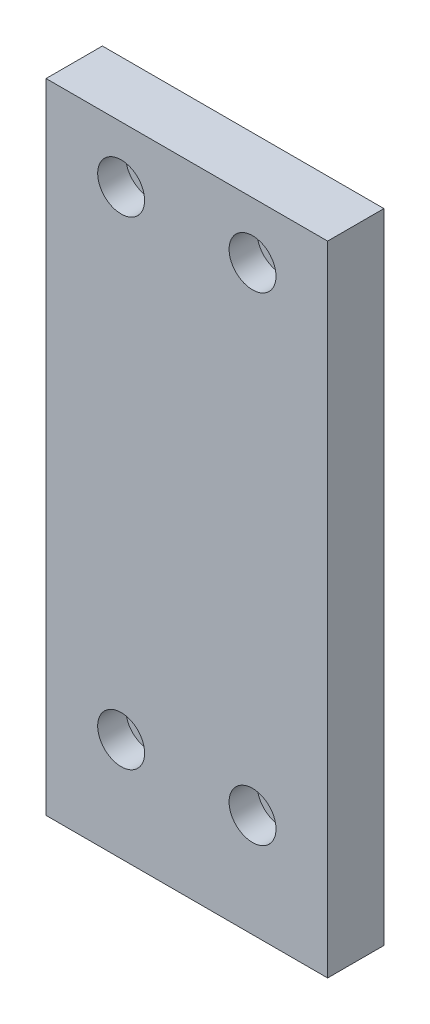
ISO-10303-21;
HEADER;
FILE_DESCRIPTION(('STEP AP214'),'2;1');
FILE_NAME('part.step','',(''),(''),'','','');
FILE_SCHEMA(('AUTOMOTIVE_DESIGN { 1 0 10303 214 1 1 1 1 }'));
ENDSEC;
DATA;
#1=APPLICATION_CONTEXT('core data for automotive mechanical design processes');
#2=APPLICATION_PROTOCOL_DEFINITION('international standard','automotive_design',2000,#1);
#3=PRODUCT_CONTEXT('',#1,'mechanical');
#4=PRODUCT('Part','Part','',(#3));
#5=PRODUCT_RELATED_PRODUCT_CATEGORY('part','',(#4));
#6=PRODUCT_DEFINITION_FORMATION('','',#4);
#7=PRODUCT_DEFINITION_CONTEXT('part definition',#1,'design');
#8=PRODUCT_DEFINITION('design','',#6,#7);
#9=PRODUCT_DEFINITION_SHAPE('','',#8);
#10=(LENGTH_UNIT() NAMED_UNIT(*) SI_UNIT(.MILLI.,.METRE.));
#11=(NAMED_UNIT(*) PLANE_ANGLE_UNIT() SI_UNIT($,.RADIAN.));
#12=(NAMED_UNIT(*) SI_UNIT($,.STERADIAN.) SOLID_ANGLE_UNIT());
#13=UNCERTAINTY_MEASURE_WITH_UNIT(LENGTH_MEASURE(1.E-05),#10,'distance_accuracy_value','');
#14=(GEOMETRIC_REPRESENTATION_CONTEXT(3) GLOBAL_UNCERTAINTY_ASSIGNED_CONTEXT((#13)) GLOBAL_UNIT_ASSIGNED_CONTEXT((#10,
#11,#12)) REPRESENTATION_CONTEXT('',''));
#15=CARTESIAN_POINT('',(0.,0.,0.));
#16=DIRECTION('',(0.,0.,1.));
#17=DIRECTION('',(1.,0.,0.));
#18=AXIS2_PLACEMENT_3D('',#15,#16,#17);
#19=CARTESIAN_POINT('',(0.,215.9,0.));
#20=DIRECTION('',(1.,0.,0.));
#21=DIRECTION('',(0.,0.,-1.));
#22=AXIS2_PLACEMENT_3D('',#19,#20,#21);
#23=PLANE('',#22);
#24=DIRECTION('',(0.,0.,1.));
#25=VECTOR('',#24,1.);
#26=CARTESIAN_POINT('',(0.,0.,0.));
#27=LINE('',#26,#25);
#28=CARTESIAN_POINT('',(0.,0.,-19.05));
#29=VERTEX_POINT('',#28);
#30=CARTESIAN_POINT('',(0.,0.,0.));
#31=VERTEX_POINT('',#30);
#32=EDGE_CURVE('E109',#29,#31,#27,.T.);
#33=ORIENTED_EDGE('',*,*,#32,.T.);
#34=DIRECTION('',(0.,-1.,0.));
#35=VECTOR('',#34,1.);
#36=CARTESIAN_POINT('',(0.,215.9,0.));
#37=LINE('',#36,#35);
#38=CARTESIAN_POINT('',(0.,215.9,0.));
#39=VERTEX_POINT('',#38);
#40=EDGE_CURVE('E11',#39,#31,#37,.T.);
#41=ORIENTED_EDGE('',*,*,#40,.F.);
#42=DIRECTION('',(0.,0.,1.));
#43=VECTOR('',#42,1.);
#44=CARTESIAN_POINT('',(0.,215.9,0.));
#45=LINE('',#44,#43);
#46=CARTESIAN_POINT('',(0.,215.9,-19.05));
#47=VERTEX_POINT('',#46);
#48=EDGE_CURVE('E110',#47,#39,#45,.T.);
#49=ORIENTED_EDGE('',*,*,#48,.F.);
#50=DIRECTION('',(0.,-1.,0.));
#51=VECTOR('',#50,1.);
#52=CARTESIAN_POINT('',(0.,215.9,-19.05));
#53=LINE('',#52,#51);
#54=EDGE_CURVE('E116',#47,#29,#53,.T.);
#55=ORIENTED_EDGE('',*,*,#54,.T.);
#56=EDGE_LOOP('',(#33,#41,#49,#55));
#57=FACE_BOUND('',#56,.T.);
#58=ADVANCED_FACE('F32',(#57),#23,.F.);
#59=CARTESIAN_POINT('',(0.,215.9,0.));
#60=DIRECTION('',(0.,0.,-1.));
#61=DIRECTION('',(-1.,0.,0.));
#62=AXIS2_PLACEMENT_3D('',#59,#60,#61);
#63=PLANE('',#62);
#64=CARTESIAN_POINT('',(25.4,34.925,0.));
#65=DIRECTION('',(0.,0.,1.));
#66=DIRECTION('',(1.,0.,0.));
#67=AXIS2_PLACEMENT_3D('',#64,#65,#66);
#68=CIRCLE('',#67,7.9375);
#69=CARTESIAN_POINT('',(33.3375,34.925,0.));
#70=VERTEX_POINT('',#69);
#71=EDGE_CURVE('E158',#70,#70,#68,.T.);
#72=ORIENTED_EDGE('',*,*,#71,.F.);
#73=EDGE_LOOP('',(#72));
#74=FACE_BOUND('',#73,.T.);
#75=CARTESIAN_POINT('',(69.85,34.925,0.));
#76=DIRECTION('',(0.,0.,1.));
#77=DIRECTION('',(1.,0.,0.));
#78=AXIS2_PLACEMENT_3D('',#75,#76,#77);
#79=CIRCLE('',#78,7.9375);
#80=CARTESIAN_POINT('',(77.7875,34.925,0.));
#81=VERTEX_POINT('',#80);
#82=EDGE_CURVE('E162',#81,#81,#79,.T.);
#83=ORIENTED_EDGE('',*,*,#82,.F.);
#84=EDGE_LOOP('',(#83));
#85=FACE_BOUND('',#84,.T.);
#86=CARTESIAN_POINT('',(69.85,196.85,0.));
#87=DIRECTION('',(0.,0.,1.));
#88=DIRECTION('',(1.,0.,0.));
#89=AXIS2_PLACEMENT_3D('',#86,#87,#88);
#90=CIRCLE('',#89,7.9375);
#91=CARTESIAN_POINT('',(77.7875,196.85,0.));
#92=VERTEX_POINT('',#91);
#93=EDGE_CURVE('E166',#92,#92,#90,.T.);
#94=ORIENTED_EDGE('',*,*,#93,.F.);
#95=EDGE_LOOP('',(#94));
#96=FACE_BOUND('',#95,.T.);
#97=CARTESIAN_POINT('',(25.4,196.85,0.));
#98=DIRECTION('',(0.,0.,1.));
#99=DIRECTION('',(1.,0.,0.));
#100=AXIS2_PLACEMENT_3D('',#97,#98,#99);
#101=CIRCLE('',#100,7.9375);
#102=CARTESIAN_POINT('',(33.3375,196.85,0.));
#103=VERTEX_POINT('',#102);
#104=EDGE_CURVE('E169',#103,#103,#101,.T.);
#105=ORIENTED_EDGE('',*,*,#104,.F.);
#106=EDGE_LOOP('',(#105));
#107=FACE_BOUND('',#106,.T.);
#108=DIRECTION('',(1.,0.,0.));
#109=VECTOR('',#108,1.);
#110=CARTESIAN_POINT('',(0.,0.,0.));
#111=LINE('',#110,#109);
#112=CARTESIAN_POINT('',(95.25,0.,0.));
#113=VERTEX_POINT('',#112);
#114=EDGE_CURVE('E119',#31,#113,#111,.T.);
#115=ORIENTED_EDGE('',*,*,#114,.T.);
#116=DIRECTION('',(0.,-1.,0.));
#117=VECTOR('',#116,1.);
#118=CARTESIAN_POINT('',(95.25,215.9,0.));
#119=LINE('',#118,#117);
#120=CARTESIAN_POINT('',(95.25,215.9,0.));
#121=VERTEX_POINT('',#120);
#122=EDGE_CURVE('E40',#121,#113,#119,.T.);
#123=ORIENTED_EDGE('',*,*,#122,.F.);
#124=DIRECTION('',(1.,0.,0.));
#125=VECTOR('',#124,1.);
#126=CARTESIAN_POINT('',(0.,215.9,0.));
#127=LINE('',#126,#125);
#128=EDGE_CURVE('E79',#39,#121,#127,.T.);
#129=ORIENTED_EDGE('',*,*,#128,.F.);
#130=ORIENTED_EDGE('',*,*,#40,.T.);
#131=EDGE_LOOP('',(#115,#123,#129,#130));
#132=FACE_BOUND('',#131,.T.);
#133=ADVANCED_FACE('F143',(#74,#85,#96,#107,#132),#63,.F.);
#134=CARTESIAN_POINT('',(95.25,215.9,0.));
#135=DIRECTION('',(-1.,0.,0.));
#136=DIRECTION('',(0.,0.,1.));
#137=AXIS2_PLACEMENT_3D('',#134,#135,#136);
#138=PLANE('',#137);
#139=DIRECTION('',(0.,0.,-1.));
#140=VECTOR('',#139,1.);
#141=CARTESIAN_POINT('',(95.25,0.,0.));
#142=LINE('',#141,#140);
#143=CARTESIAN_POINT('',(95.25,0.,-19.05));
#144=VERTEX_POINT('',#143);
#145=EDGE_CURVE('E66',#113,#144,#142,.T.);
#146=ORIENTED_EDGE('',*,*,#145,.T.);
#147=DIRECTION('',(0.,-1.,0.));
#148=VECTOR('',#147,1.);
#149=CARTESIAN_POINT('',(95.25,215.9,-19.05));
#150=LINE('',#149,#148);
#151=CARTESIAN_POINT('',(95.25,215.9,-19.05));
#152=VERTEX_POINT('',#151);
#153=EDGE_CURVE('E124',#152,#144,#150,.T.);
#154=ORIENTED_EDGE('',*,*,#153,.F.);
#155=DIRECTION('',(0.,0.,-1.));
#156=VECTOR('',#155,1.);
#157=CARTESIAN_POINT('',(95.25,215.9,0.));
#158=LINE('',#157,#156);
#159=EDGE_CURVE('E113',#121,#152,#158,.T.);
#160=ORIENTED_EDGE('',*,*,#159,.F.);
#161=ORIENTED_EDGE('',*,*,#122,.T.);
#162=EDGE_LOOP('',(#146,#154,#160,#161));
#163=FACE_BOUND('',#162,.T.);
#164=ADVANCED_FACE('F126',(#163),#138,.F.);
#165=CARTESIAN_POINT('',(0.,215.9,-19.05));
#166=DIRECTION('',(0.,0.,1.));
#167=DIRECTION('',(1.,0.,0.));
#168=AXIS2_PLACEMENT_3D('',#165,#166,#167);
#169=PLANE('',#168);
#170=CARTESIAN_POINT('',(25.4,34.925,-19.05));
#171=DIRECTION('',(0.,0.,1.));
#172=DIRECTION('',(1.,0.,0.));
#173=AXIS2_PLACEMENT_3D('',#170,#171,#172);
#174=CIRCLE('',#173,5.04189999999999);
#175=CARTESIAN_POINT('',(30.4419,34.925,-19.05));
#176=VERTEX_POINT('',#175);
#177=EDGE_CURVE('E356',#176,#176,#174,.T.);
#178=ORIENTED_EDGE('',*,*,#177,.T.);
#179=EDGE_LOOP('',(#178));
#180=FACE_BOUND('',#179,.T.);
#181=CARTESIAN_POINT('',(69.85,34.925,-19.05));
#182=DIRECTION('',(0.,0.,1.));
#183=DIRECTION('',(1.,0.,0.));
#184=AXIS2_PLACEMENT_3D('',#181,#182,#183);
#185=CIRCLE('',#184,5.0419);
#186=CARTESIAN_POINT('',(74.8919,34.925,-19.05));
#187=VERTEX_POINT('',#186);
#188=EDGE_CURVE('E365',#187,#187,#185,.T.);
#189=ORIENTED_EDGE('',*,*,#188,.T.);
#190=EDGE_LOOP('',(#189));
#191=FACE_BOUND('',#190,.T.);
#192=CARTESIAN_POINT('',(69.85,196.85,-19.05));
#193=DIRECTION('',(0.,0.,1.));
#194=DIRECTION('',(1.,0.,0.));
#195=AXIS2_PLACEMENT_3D('',#192,#193,#194);
#196=CIRCLE('',#195,5.0419);
#197=CARTESIAN_POINT('',(74.8919,196.85,-19.05));
#198=VERTEX_POINT('',#197);
#199=EDGE_CURVE('E172',#198,#198,#196,.T.);
#200=ORIENTED_EDGE('',*,*,#199,.T.);
#201=EDGE_LOOP('',(#200));
#202=FACE_BOUND('',#201,.T.);
#203=CARTESIAN_POINT('',(25.4,196.85,-19.05));
#204=DIRECTION('',(0.,0.,1.));
#205=DIRECTION('',(1.,0.,0.));
#206=AXIS2_PLACEMENT_3D('',#203,#204,#205);
#207=CIRCLE('',#206,5.04189999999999);
#208=CARTESIAN_POINT('',(30.4419,196.85,-19.05));
#209=VERTEX_POINT('',#208);
#210=EDGE_CURVE('E103',#209,#209,#207,.T.);
#211=ORIENTED_EDGE('',*,*,#210,.T.);
#212=EDGE_LOOP('',(#211));
#213=FACE_BOUND('',#212,.T.);
#214=DIRECTION('',(-1.,0.,0.));
#215=VECTOR('',#214,1.);
#216=CARTESIAN_POINT('',(0.,0.,-19.05));
#217=LINE('',#216,#215);
#218=EDGE_CURVE('E72',#144,#29,#217,.T.);
#219=ORIENTED_EDGE('',*,*,#218,.T.);
#220=ORIENTED_EDGE('',*,*,#54,.F.);
#221=DIRECTION('',(-1.,0.,0.));
#222=VECTOR('',#221,1.);
#223=CARTESIAN_POINT('',(0.,215.9,-19.05));
#224=LINE('',#223,#222);
#225=EDGE_CURVE('E48',#152,#47,#224,.T.);
#226=ORIENTED_EDGE('',*,*,#225,.F.);
#227=ORIENTED_EDGE('',*,*,#153,.T.);
#228=EDGE_LOOP('',(#219,#220,#226,#227));
#229=FACE_BOUND('',#228,.T.);
#230=ADVANCED_FACE('F133',(#180,#191,#202,#213,#229),#169,.F.);
#231=CARTESIAN_POINT('',(0.,215.9,-19.05));
#232=DIRECTION('',(0.,-1.,0.));
#233=DIRECTION('',(0.,0.,-1.));
#234=AXIS2_PLACEMENT_3D('',#231,#232,#233);
#235=PLANE('',#234);
#236=ORIENTED_EDGE('',*,*,#48,.T.);
#237=ORIENTED_EDGE('',*,*,#128,.T.);
#238=ORIENTED_EDGE('',*,*,#159,.T.);
#239=ORIENTED_EDGE('',*,*,#225,.T.);
#240=EDGE_LOOP('',(#236,#237,#238,#239));
#241=FACE_BOUND('',#240,.T.);
#242=ADVANCED_FACE('F135',(#241),#235,.F.);
#243=CARTESIAN_POINT('',(0.,0.,-19.05));
#244=DIRECTION('',(0.,-1.,0.));
#245=DIRECTION('',(0.,0.,-1.));
#246=AXIS2_PLACEMENT_3D('',#243,#244,#245);
#247=PLANE('',#246);
#248=CARTESIAN_POINT('',(9.52500000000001,0.,-9.525));
#249=DIRECTION('',(0.,-1.,0.));
#250=DIRECTION('',(0.,0.,-1.));
#251=AXIS2_PLACEMENT_3D('',#248,#249,#250);
#252=CIRCLE('',#251,3.96875);
#253=CARTESIAN_POINT('',(9.52500000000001,0.,-13.49375));
#254=VERTEX_POINT('',#253);
#255=EDGE_CURVE('E97',#254,#254,#252,.T.);
#256=ORIENTED_EDGE('',*,*,#255,.F.);
#257=EDGE_LOOP('',(#256));
#258=FACE_BOUND('',#257,.T.);
#259=CARTESIAN_POINT('',(85.725,0.,-9.525));
#260=DIRECTION('',(0.,-1.,0.));
#261=DIRECTION('',(0.,0.,-1.));
#262=AXIS2_PLACEMENT_3D('',#259,#260,#261);
#263=CIRCLE('',#262,3.96874999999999);
#264=CARTESIAN_POINT('',(85.725,0.,-13.49375));
#265=VERTEX_POINT('',#264);
#266=EDGE_CURVE('E96',#265,#265,#263,.T.);
#267=ORIENTED_EDGE('',*,*,#266,.F.);
#268=EDGE_LOOP('',(#267));
#269=FACE_BOUND('',#268,.T.);
#270=ORIENTED_EDGE('',*,*,#32,.F.);
#271=ORIENTED_EDGE('',*,*,#218,.F.);
#272=ORIENTED_EDGE('',*,*,#145,.F.);
#273=ORIENTED_EDGE('',*,*,#114,.F.);
#274=EDGE_LOOP('',(#270,#271,#272,#273));
#275=FACE_BOUND('',#274,.T.);
#276=ADVANCED_FACE('F129',(#258,#269,#275),#247,.T.);
#277=CARTESIAN_POINT('',(85.725,26.924,-9.525));
#278=DIRECTION('',(0.,-1.,0.));
#279=DIRECTION('',(0.,0.,-1.));
#280=AXIS2_PLACEMENT_3D('',#277,#278,#279);
#281=CONICAL_SURFACE('',#280,3.96874999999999,1.02974425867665);
#282=CARTESIAN_POINT('',(85.725,29.3086655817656,-9.525));
#283=VERTEX_POINT('',#282);
#284=VERTEX_LOOP('',#283);
#285=FACE_BOUND('',#284,.T.);
#286=CARTESIAN_POINT('',(85.725,26.924,-9.525));
#287=DIRECTION('',(0.,-1.,0.));
#288=DIRECTION('',(0.,0.,-1.));
#289=AXIS2_PLACEMENT_3D('',#286,#287,#288);
#290=CIRCLE('',#289,3.96874999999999);
#291=CARTESIAN_POINT('',(85.725,26.924,-13.49375));
#292=VERTEX_POINT('',#291);
#293=EDGE_CURVE('E100',#292,#292,#290,.T.);
#294=ORIENTED_EDGE('',*,*,#293,.T.);
#295=EDGE_LOOP('',(#294));
#296=FACE_BOUND('',#295,.T.);
#297=ADVANCED_FACE('F215',(#285,#296),#281,.F.);
#298=CARTESIAN_POINT('',(85.725,0.,-9.525));
#299=DIRECTION('',(0.,-1.,0.));
#300=DIRECTION('',(0.,0.,-1.));
#301=AXIS2_PLACEMENT_3D('',#298,#299,#300);
#302=CYLINDRICAL_SURFACE('',#301,3.96874999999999);
#303=ORIENTED_EDGE('',*,*,#293,.F.);
#304=EDGE_LOOP('',(#303));
#305=FACE_BOUND('',#304,.T.);
#306=ORIENTED_EDGE('',*,*,#266,.T.);
#307=EDGE_LOOP('',(#306));
#308=FACE_BOUND('',#307,.T.);
#309=ADVANCED_FACE('F90',(#305,#308),#302,.F.);
#310=CARTESIAN_POINT('',(9.52500000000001,26.924,-9.525));
#311=DIRECTION('',(0.,-1.,0.));
#312=DIRECTION('',(0.,0.,-1.));
#313=AXIS2_PLACEMENT_3D('',#310,#311,#312);
#314=CONICAL_SURFACE('',#313,3.96874999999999,1.02974425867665);
#315=CARTESIAN_POINT('',(9.525,29.3086655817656,-9.525));
#316=VERTEX_POINT('',#315);
#317=VERTEX_LOOP('',#316);
#318=FACE_BOUND('',#317,.T.);
#319=CARTESIAN_POINT('',(9.52500000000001,26.924,-9.525));
#320=DIRECTION('',(0.,-1.,0.));
#321=DIRECTION('',(0.,0.,-1.));
#322=AXIS2_PLACEMENT_3D('',#319,#320,#321);
#323=CIRCLE('',#322,3.96874999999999);
#324=CARTESIAN_POINT('',(9.52500000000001,26.924,-13.49375));
#325=VERTEX_POINT('',#324);
#326=EDGE_CURVE('E94',#325,#325,#323,.T.);
#327=ORIENTED_EDGE('',*,*,#326,.T.);
#328=EDGE_LOOP('',(#327));
#329=FACE_BOUND('',#328,.T.);
#330=ADVANCED_FACE('F86',(#318,#329),#314,.F.);
#331=CARTESIAN_POINT('',(9.52500000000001,0.,-9.525));
#332=DIRECTION('',(0.,-1.,0.));
#333=DIRECTION('',(0.,0.,-1.));
#334=AXIS2_PLACEMENT_3D('',#331,#332,#333);
#335=CYLINDRICAL_SURFACE('',#334,3.96875);
#336=ORIENTED_EDGE('',*,*,#326,.F.);
#337=EDGE_LOOP('',(#336));
#338=FACE_BOUND('',#337,.T.);
#339=ORIENTED_EDGE('',*,*,#255,.T.);
#340=EDGE_LOOP('',(#339));
#341=FACE_BOUND('',#340,.T.);
#342=ADVANCED_FACE('F89',(#338,#341),#335,.F.);
#343=CARTESIAN_POINT('',(25.4,196.85,0.));
#344=DIRECTION('',(0.,0.,1.));
#345=DIRECTION('',(1.,0.,0.));
#346=AXIS2_PLACEMENT_3D('',#343,#344,#345);
#347=CYLINDRICAL_SURFACE('',#346,5.0419);
#348=ORIENTED_EDGE('',*,*,#210,.F.);
#349=EDGE_LOOP('',(#348));
#350=FACE_BOUND('',#349,.T.);
#351=CARTESIAN_POINT('',(25.4,196.85,-9.525));
#352=DIRECTION('',(0.,0.,1.));
#353=DIRECTION('',(1.,0.,0.));
#354=AXIS2_PLACEMENT_3D('',#351,#352,#353);
#355=CIRCLE('',#354,5.04190000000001);
#356=CARTESIAN_POINT('',(30.4419,196.85,-9.525));
#357=VERTEX_POINT('',#356);
#358=EDGE_CURVE('E175',#357,#357,#355,.T.);
#359=ORIENTED_EDGE('',*,*,#358,.T.);
#360=EDGE_LOOP('',(#359));
#361=FACE_BOUND('',#360,.T.);
#362=ADVANCED_FACE('F187',(#350,#361),#347,.F.);
#363=CARTESIAN_POINT('',(30.4419,196.85,-9.525));
#364=DIRECTION('',(0.,0.,-1.));
#365=DIRECTION('',(-1.,0.,0.));
#366=AXIS2_PLACEMENT_3D('',#363,#364,#365);
#367=PLANE('',#366);
#368=ORIENTED_EDGE('',*,*,#358,.F.);
#369=EDGE_LOOP('',(#368));
#370=FACE_BOUND('',#369,.T.);
#371=CARTESIAN_POINT('',(25.4,196.85,-9.525));
#372=DIRECTION('',(0.,0.,1.));
#373=DIRECTION('',(1.,0.,0.));
#374=AXIS2_PLACEMENT_3D('',#371,#372,#373);
#375=CIRCLE('',#374,7.93749999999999);
#376=CARTESIAN_POINT('',(33.3375,196.85,-9.525));
#377=VERTEX_POINT('',#376);
#378=EDGE_CURVE('E171',#377,#377,#375,.T.);
#379=ORIENTED_EDGE('',*,*,#378,.T.);
#380=EDGE_LOOP('',(#379));
#381=FACE_BOUND('',#380,.T.);
#382=ADVANCED_FACE('F190',(#370,#381),#367,.F.);
#383=CARTESIAN_POINT('',(25.4,196.85,0.));
#384=DIRECTION('',(0.,0.,1.));
#385=DIRECTION('',(1.,0.,0.));
#386=AXIS2_PLACEMENT_3D('',#383,#384,#385);
#387=CYLINDRICAL_SURFACE('',#386,7.9375);
#388=ORIENTED_EDGE('',*,*,#378,.F.);
#389=EDGE_LOOP('',(#388));
#390=FACE_BOUND('',#389,.T.);
#391=ORIENTED_EDGE('',*,*,#104,.T.);
#392=EDGE_LOOP('',(#391));
#393=FACE_BOUND('',#392,.T.);
#394=ADVANCED_FACE('F196',(#390,#393),#387,.F.);
#395=CARTESIAN_POINT('',(69.85,196.85,0.));
#396=DIRECTION('',(0.,0.,1.));
#397=DIRECTION('',(1.,0.,0.));
#398=AXIS2_PLACEMENT_3D('',#395,#396,#397);
#399=CYLINDRICAL_SURFACE('',#398,5.04190000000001);
#400=ORIENTED_EDGE('',*,*,#199,.F.);
#401=EDGE_LOOP('',(#400));
#402=FACE_BOUND('',#401,.T.);
#403=CARTESIAN_POINT('',(69.85,196.85,-9.525));
#404=DIRECTION('',(0.,0.,1.));
#405=DIRECTION('',(1.,0.,0.));
#406=AXIS2_PLACEMENT_3D('',#403,#404,#405);
#407=CIRCLE('',#406,5.04190000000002);
#408=CARTESIAN_POINT('',(74.8919,196.85,-9.525));
#409=VERTEX_POINT('',#408);
#410=EDGE_CURVE('E178',#409,#409,#407,.T.);
#411=ORIENTED_EDGE('',*,*,#410,.T.);
#412=EDGE_LOOP('',(#411));
#413=FACE_BOUND('',#412,.T.);
#414=ADVANCED_FACE('F201',(#402,#413),#399,.F.);
#415=CARTESIAN_POINT('',(74.8919,196.85,-9.525));
#416=DIRECTION('',(0.,0.,-1.));
#417=DIRECTION('',(-1.,0.,0.));
#418=AXIS2_PLACEMENT_3D('',#415,#416,#417);
#419=PLANE('',#418);
#420=ORIENTED_EDGE('',*,*,#410,.F.);
#421=EDGE_LOOP('',(#420));
#422=FACE_BOUND('',#421,.T.);
#423=CARTESIAN_POINT('',(69.85,196.85,-9.525));
#424=DIRECTION('',(0.,0.,1.));
#425=DIRECTION('',(1.,0.,0.));
#426=AXIS2_PLACEMENT_3D('',#423,#424,#425);
#427=CIRCLE('',#426,7.93749999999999);
#428=CARTESIAN_POINT('',(77.7875,196.85,-9.525));
#429=VERTEX_POINT('',#428);
#430=EDGE_CURVE('E369',#429,#429,#427,.T.);
#431=ORIENTED_EDGE('',*,*,#430,.T.);
#432=EDGE_LOOP('',(#431));
#433=FACE_BOUND('',#432,.T.);
#434=ADVANCED_FACE('F206',(#422,#433),#419,.F.);
#435=CARTESIAN_POINT('',(69.85,196.85,0.));
#436=DIRECTION('',(0.,0.,1.));
#437=DIRECTION('',(1.,0.,0.));
#438=AXIS2_PLACEMENT_3D('',#435,#436,#437);
#439=CYLINDRICAL_SURFACE('',#438,7.93749999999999);
#440=ORIENTED_EDGE('',*,*,#430,.F.);
#441=EDGE_LOOP('',(#440));
#442=FACE_BOUND('',#441,.T.);
#443=ORIENTED_EDGE('',*,*,#93,.T.);
#444=EDGE_LOOP('',(#443));
#445=FACE_BOUND('',#444,.T.);
#446=ADVANCED_FACE('F273',(#442,#445),#439,.F.);
#447=CARTESIAN_POINT('',(69.85,34.925,0.));
#448=DIRECTION('',(0.,0.,1.));
#449=DIRECTION('',(1.,0.,0.));
#450=AXIS2_PLACEMENT_3D('',#447,#448,#449);
#451=CYLINDRICAL_SURFACE('',#450,5.04190000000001);
#452=ORIENTED_EDGE('',*,*,#188,.F.);
#453=EDGE_LOOP('',(#452));
#454=FACE_BOUND('',#453,.T.);
#455=CARTESIAN_POINT('',(69.85,34.925,-9.525));
#456=DIRECTION('',(0.,0.,1.));
#457=DIRECTION('',(1.,0.,0.));
#458=AXIS2_PLACEMENT_3D('',#455,#456,#457);
#459=CIRCLE('',#458,5.04190000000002);
#460=CARTESIAN_POINT('',(74.8919,34.925,-9.525));
#461=VERTEX_POINT('',#460);
#462=EDGE_CURVE('E362',#461,#461,#459,.T.);
#463=ORIENTED_EDGE('',*,*,#462,.T.);
#464=EDGE_LOOP('',(#463));
#465=FACE_BOUND('',#464,.T.);
#466=ADVANCED_FACE('F282',(#454,#465),#451,.F.);
#467=CARTESIAN_POINT('',(74.8919,34.925,-9.525));
#468=DIRECTION('',(0.,0.,-1.));
#469=DIRECTION('',(-1.,0.,0.));
#470=AXIS2_PLACEMENT_3D('',#467,#468,#469);
#471=PLANE('',#470);
#472=ORIENTED_EDGE('',*,*,#462,.F.);
#473=EDGE_LOOP('',(#472));
#474=FACE_BOUND('',#473,.T.);
#475=CARTESIAN_POINT('',(69.85,34.925,-9.525));
#476=DIRECTION('',(0.,0.,1.));
#477=DIRECTION('',(1.,0.,0.));
#478=AXIS2_PLACEMENT_3D('',#475,#476,#477);
#479=CIRCLE('',#478,7.93749999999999);
#480=CARTESIAN_POINT('',(77.7875,34.925,-9.525));
#481=VERTEX_POINT('',#480);
#482=EDGE_CURVE('E359',#481,#481,#479,.T.);
#483=ORIENTED_EDGE('',*,*,#482,.T.);
#484=EDGE_LOOP('',(#483));
#485=FACE_BOUND('',#484,.T.);
#486=ADVANCED_FACE('F292',(#474,#485),#471,.F.);
#487=CARTESIAN_POINT('',(69.85,34.925,0.));
#488=DIRECTION('',(0.,0.,1.));
#489=DIRECTION('',(1.,0.,0.));
#490=AXIS2_PLACEMENT_3D('',#487,#488,#489);
#491=CYLINDRICAL_SURFACE('',#490,7.93749999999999);
#492=ORIENTED_EDGE('',*,*,#482,.F.);
#493=EDGE_LOOP('',(#492));
#494=FACE_BOUND('',#493,.T.);
#495=ORIENTED_EDGE('',*,*,#82,.T.);
#496=EDGE_LOOP('',(#495));
#497=FACE_BOUND('',#496,.T.);
#498=ADVANCED_FACE('F302',(#494,#497),#491,.F.);
#499=CARTESIAN_POINT('',(25.4,34.925,0.));
#500=DIRECTION('',(0.,0.,1.));
#501=DIRECTION('',(1.,0.,0.));
#502=AXIS2_PLACEMENT_3D('',#499,#500,#501);
#503=CYLINDRICAL_SURFACE('',#502,5.0419);
#504=ORIENTED_EDGE('',*,*,#177,.F.);
#505=EDGE_LOOP('',(#504));
#506=FACE_BOUND('',#505,.T.);
#507=CARTESIAN_POINT('',(25.4,34.925,-9.525));
#508=DIRECTION('',(0.,0.,1.));
#509=DIRECTION('',(1.,0.,0.));
#510=AXIS2_PLACEMENT_3D('',#507,#508,#509);
#511=CIRCLE('',#510,5.04190000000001);
#512=CARTESIAN_POINT('',(30.4419,34.925,-9.525));
#513=VERTEX_POINT('',#512);
#514=EDGE_CURVE('E351',#513,#513,#511,.T.);
#515=ORIENTED_EDGE('',*,*,#514,.T.);
#516=EDGE_LOOP('',(#515));
#517=FACE_BOUND('',#516,.T.);
#518=ADVANCED_FACE('F312',(#506,#517),#503,.F.);
#519=CARTESIAN_POINT('',(30.4419,34.925,-9.525));
#520=DIRECTION('',(0.,0.,-1.));
#521=DIRECTION('',(-1.,0.,0.));
#522=AXIS2_PLACEMENT_3D('',#519,#520,#521);
#523=PLANE('',#522);
#524=ORIENTED_EDGE('',*,*,#514,.F.);
#525=EDGE_LOOP('',(#524));
#526=FACE_BOUND('',#525,.T.);
#527=CARTESIAN_POINT('',(25.4,34.925,-9.525));
#528=DIRECTION('',(0.,0.,1.));
#529=DIRECTION('',(1.,0.,0.));
#530=AXIS2_PLACEMENT_3D('',#527,#528,#529);
#531=CIRCLE('',#530,7.93749999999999);
#532=CARTESIAN_POINT('',(33.3375,34.925,-9.525));
#533=VERTEX_POINT('',#532);
#534=EDGE_CURVE('E349',#533,#533,#531,.T.);
#535=ORIENTED_EDGE('',*,*,#534,.T.);
#536=EDGE_LOOP('',(#535));
#537=FACE_BOUND('',#536,.T.);
#538=ADVANCED_FACE('F322',(#526,#537),#523,.F.);
#539=CARTESIAN_POINT('',(25.4,34.925,0.));
#540=DIRECTION('',(0.,0.,1.));
#541=DIRECTION('',(1.,0.,0.));
#542=AXIS2_PLACEMENT_3D('',#539,#540,#541);
#543=CYLINDRICAL_SURFACE('',#542,7.9375);
#544=ORIENTED_EDGE('',*,*,#534,.F.);
#545=EDGE_LOOP('',(#544));
#546=FACE_BOUND('',#545,.T.);
#547=ORIENTED_EDGE('',*,*,#71,.T.);
#548=EDGE_LOOP('',(#547));
#549=FACE_BOUND('',#548,.T.);
#550=ADVANCED_FACE('F332',(#546,#549),#543,.F.);
#551=CLOSED_SHELL('',(#58,#133,#164,#230,#242,#276,#297,#309,#330,#342,#362,#382,#394,#414,#434,
#446,#466,#486,#498,#518,#538,#550));
#552=MANIFOLD_SOLID_BREP('B2',#551);
#553=ADVANCED_BREP_SHAPE_REPRESENTATION('',(#18,#552),#14);
#554=SHAPE_DEFINITION_REPRESENTATION(#9,#553);
ENDSEC;
END-ISO-10303-21;
